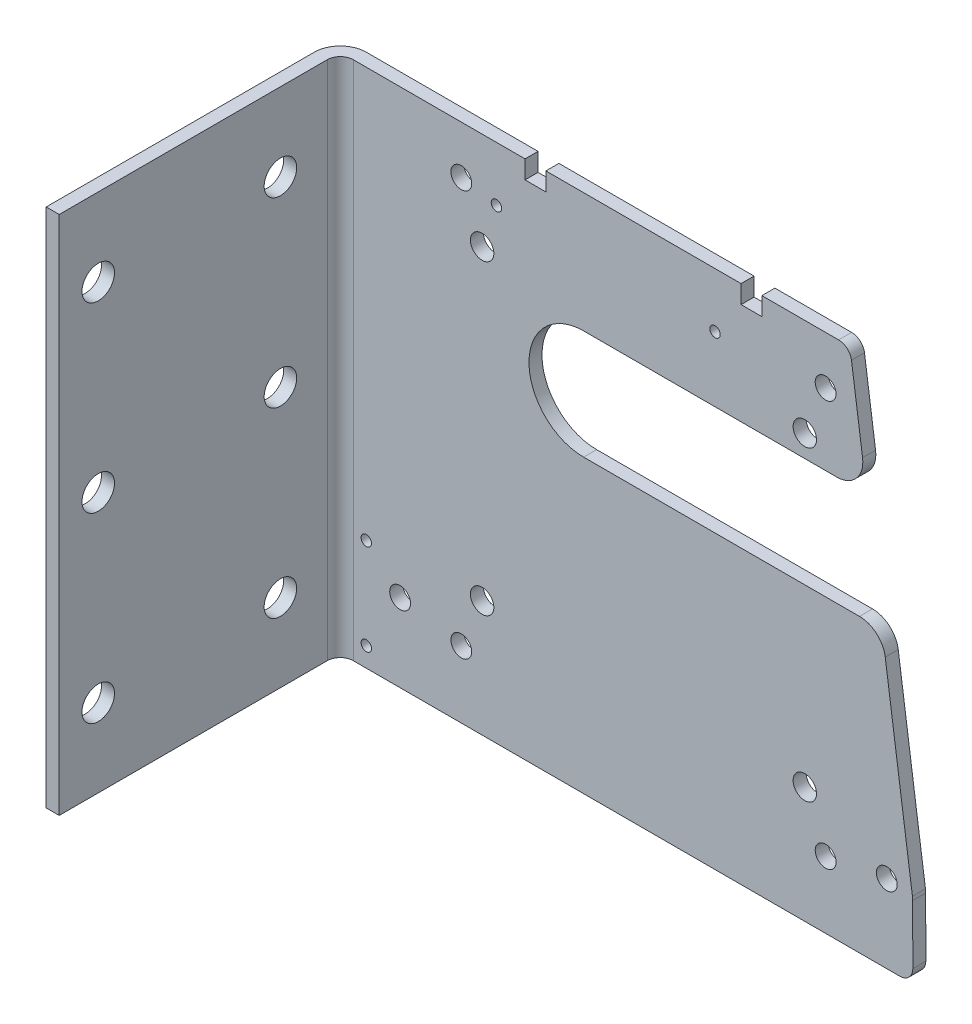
from build123d import *

# Parameters (mm, degrees)
ESQUISSE1_R                     = 4.5
ESQUISSE1_R_2                   = 4
EXTRUSION1_DEPTH                = 5
TROU_TARAUD_M4X0_71_D           = 3.3
TROU_TARAUD_M4X0_71_DEPTH       = 10.1
TROU_TARAUD_M4X0_71_CBORE_D     = 4
TROU_TARAUD_M4X0_71_CBORE_DEPTH = 8
TROU_TARAUD_M4X0_71_TIP         = 0.991420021
ESQUISSE3_W                     = 5
ESQUISSE3_H                     = 200
EXTRUSION2_DEPTH                = 108
CONG_1_R                        = 10
CONG_2_R                        = 5
ESQUISSE4_R                     = 6.25
ENL_V_MAT_EXTRU_1_DEPTH         = 273.255568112


with BuildPart() as part:
    # Esquisse1 → Extrusion1 (new body)
    with BuildSketch(Plane.XY):
        with BuildLine():
            Line((-121.5, 96.4), (-121.5, -103.6))
            Line((-121.5, -103.6), (98.491409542, -103.6))
            ThreePointArc((98.491409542, -103.6), (102.029976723, -102.132498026), (103.491402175, -98.591416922))
            Line((103.491402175, -98.591416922), (103.452525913, -75.944411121))
            ThreePointArc((103.452525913, -75.944411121), (103.42757875, -75.255450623), (103.355221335, -74.569846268))
            Line((103.355221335, -74.569846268), (92.904383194, -0.20826899))
            ThreePointArc((92.904383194, -0.20826899), (89.562292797, 5.947095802), (83.001702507, 8.4))
            Line((83.001702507, 8.4), (-22.994, 8.4))
            ThreePointArc((-22.994, 8.4), (-43.994, 29.4), (-22.994, 50.4))
            Line((-22.994, 50.4), (74.288170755, 50.4))
            ThreePointArc((74.288170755, 50.4), (81.835266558, 53.83940971), (84.190851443, 61.79173101))
            Line((84.190851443, 61.79173101), (79.931883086, 92.095865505))
            ThreePointArc((79.931883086, 92.095865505), (78.260837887, 95.173547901), (74.980542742, 96.4))
            Line((74.980542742, 96.4), (45.5, 96.4))
            Line((45.5, 96.4), (45.5, 89.4))
            Line((45.5, 89.4), (37.5, 89.4))
            Line((37.5, 89.4), (37.5, 96.4))
            Line((37.5, 96.4), (-37.5, 96.4))
            Line((-37.5, 96.4), (-37.5, 89.4))
            Line((-37.5, 89.4), (-45.5, 89.4))
            Line((-45.5, 89.4), (-45.5, 96.4))
            Line((-45.5, 96.4), (-121.5, 96.4))
        make_face()
        with Locations((-62, -58.9)):
            Circle(ESQUISSE1_R, mode=Mode.SUBTRACT)
        with Locations((62, -58.9)):
            Circle(ESQUISSE1_R, mode=Mode.SUBTRACT)
        with Locations((62, 58.9)):
            Circle(ESQUISSE1_R, mode=Mode.SUBTRACT)
        with Locations((-62, 58.9)):
            Circle(ESQUISSE1_R, mode=Mode.SUBTRACT)
        with Locations((-70, 77.9)):
            Circle(ESQUISSE1_R_2, mode=Mode.SUBTRACT)
        with Locations((70, 77.9)):
            Circle(ESQUISSE1_R_2, mode=Mode.SUBTRACT)
        with Locations((93.5, -73.6)):
            Circle(ESQUISSE1_R_2, mode=Mode.SUBTRACT)
        with Locations((70, -77.9)):
            Circle(ESQUISSE1_R_2, mode=Mode.SUBTRACT)
        with Locations((-70, -77.9)):
            Circle(ESQUISSE1_R_2, mode=Mode.SUBTRACT)
        with Locations((-93.5, -73.6)):
            Circle(ESQUISSE1_R_2, mode=Mode.SUBTRACT)
    extrude(amount=EXTRUSION1_DEPTH)

    # Trou taraud_ M4x0.71
    with Locations(Plane(origin=(-56.5, 75.4, 5), x_dir=(1, 0, 0), z_dir=(0, 0, 1))):
        with Locations((0, 0), (84, 0), (-50, -136.5), (-50, -171.5)):
            CounterBoreHole(TROU_TARAUD_M4X0_71_D / 2, TROU_TARAUD_M4X0_71_CBORE_D / 2, TROU_TARAUD_M4X0_71_CBORE_DEPTH, depth=TROU_TARAUD_M4X0_71_DEPTH)
            with Locations((0, 0, -(TROU_TARAUD_M4X0_71_DEPTH + TROU_TARAUD_M4X0_71_TIP / 2))):  # 118° drill point
                Cone(0, TROU_TARAUD_M4X0_71_D / 2, TROU_TARAUD_M4X0_71_TIP, mode=Mode.SUBTRACT)

    # Esquisse3 → Extrusion2 (add)
    with BuildSketch(Plane.XY.offset(5)):
        with Locations((-119, -3.6)):
            Rectangle(ESQUISSE3_W, ESQUISSE3_H)
    extrude(amount=EXTRUSION2_DEPTH)

    # Cong_1
    cong_1_edges = [part.edges().sort_by_distance(p)[0] for p in [
        (-121.5, -3.6, 0),
    ]]
    fillet(cong_1_edges, radius=CONG_1_R)

    # Cong_2
    cong_2_edges = [part.edges().sort_by_distance(p)[0] for p in [
        (-116.5, -3.6, 5),
    ]]
    fillet(cong_2_edges, radius=CONG_2_R)

    # Esquisse4 → Enl_v. mat.-Extru.1 (cut, through all)
    with BuildSketch(Plane.ZY.offset(121.5)):
        with Locations(Location((28, -73.6, 0), (0, 0, 270))):
            Circle(ESQUISSE4_R)
        with Locations(Location((28, -3.6, 0), (0, 0, 270))):
            Circle(ESQUISSE4_R)
        with Locations(Location((28, 66.4, 0), (0, 0, 270))):
            Circle(ESQUISSE4_R)
        with Locations(Location((98, -3.6, 0), (0, 0, 270))):
            Circle(ESQUISSE4_R)
        with Locations(Location((98, -73.6, 0), (0, 0, 270))):
            Circle(ESQUISSE4_R)
        with Locations(Location((98, 66.4, 0), (0, 0, 270))):
            Circle(ESQUISSE4_R)
    extrude(amount=-ENL_V_MAT_EXTRU_1_DEPTH, mode=Mode.SUBTRACT)


solid = part.part
